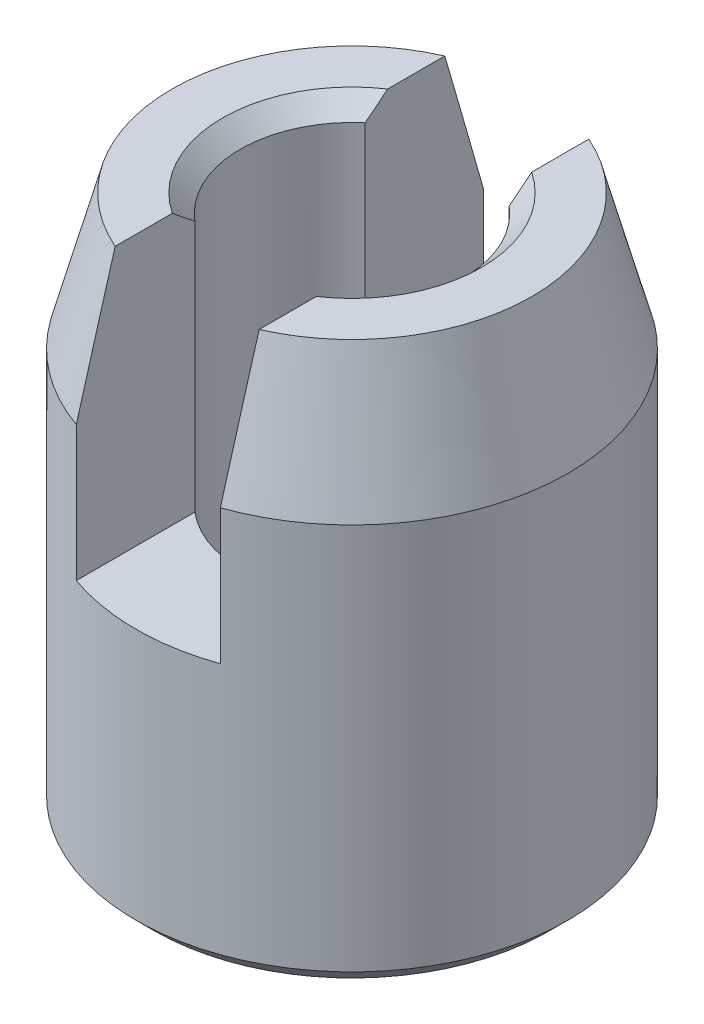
from build123d import *

# Parameters (mm, degrees)
FASE1_SIZE                           = 0.333333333
SCHNITT_LINEAR_AUSTRAGEN1_DEPTH      = 12.489125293
SCHNITT_LINEAR_AUSTRAGEN1_DEPTH_BACK = 12.489125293
SKIZZE2_W                            = 2.666666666
SKIZZE2_H                            = 5


with BuildPart() as part:
    # Skizze1 → Rotation1 (revolve)
    with BuildSketch(Plane.XY, mode=Mode.PRIVATE) as rotation1_sk:
        Polygon((2.065, 0), (2.065, 10), (3.330127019, 10), (4, 7.5), (4, 0), align=None)
    revolve(rotation1_sk.sketch.rotate(Axis((0, 0, 0), (0, 1, 0)), 90), axis=Axis((0, 0, 0), (0, 1, 0)))

    # Fase1
    fase1_edges = [part.edges().sort_by_distance(p)[0] for p in [
        (0, 10, 2.065),
        (0, 0, 2.065),
        (0, 0, 4),
    ]]
    chamfer(fase1_edges, length=FASE1_SIZE)

    # Skizze2 → Schnitt-Linear austragen1 (cut, two sides: drawn at the far end of the back side and taken through both)
    with BuildSketch(Plane.XY.offset(-SCHNITT_LINEAR_AUSTRAGEN1_DEPTH_BACK)):
        with Locations((0, 7.5)):
            Rectangle(SKIZZE2_W, SKIZZE2_H)
    extrude(amount=SCHNITT_LINEAR_AUSTRAGEN1_DEPTH + SCHNITT_LINEAR_AUSTRAGEN1_DEPTH_BACK, mode=Mode.SUBTRACT)


solid = part.part
